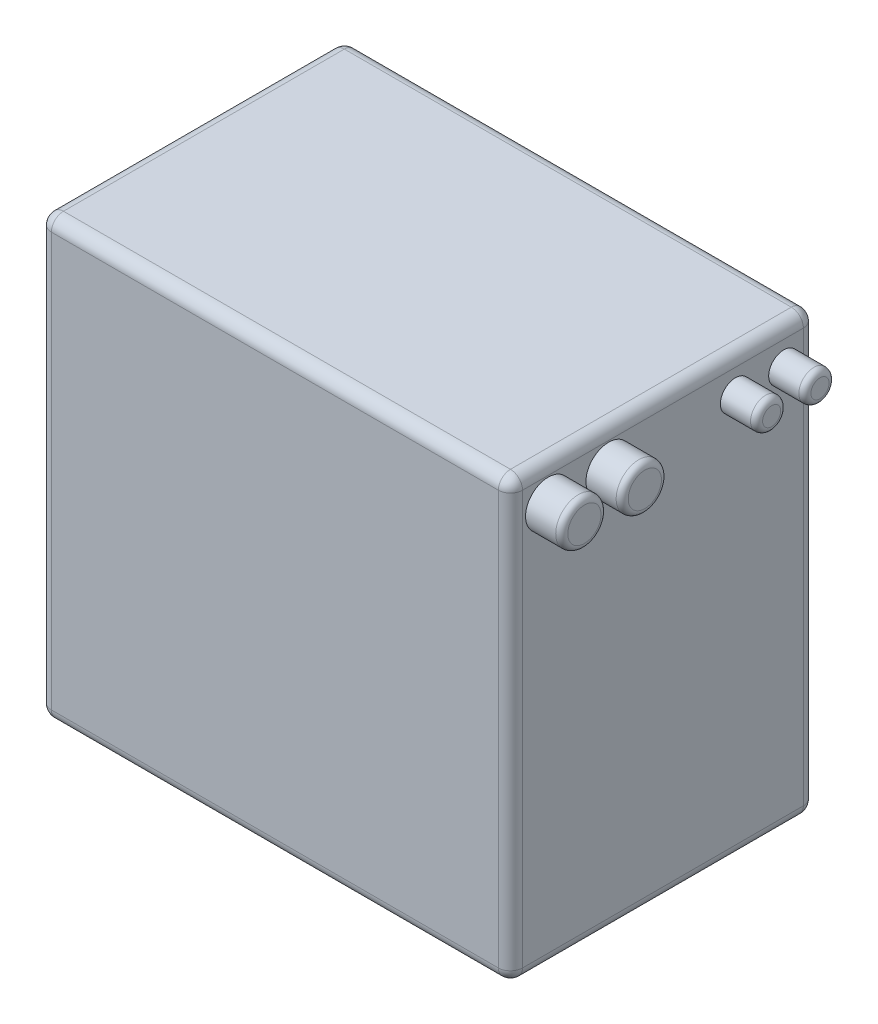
from build123d import *

# Parameters (mm, degrees)
SKETCH1_W             = 247.65
SKETCH1_H             = 230.1748
BOSS_EXTRUDE1_DEPTH   = 80.1624
FILLET1_R             = 6.35
SKETCH2_R             = 7.9375
BOSS_EXTRUDE2_DEPTH   = 19.05
BOSS_EXTRUDE2_2_DEPTH = 19.05
SKETCH2_R_2           = 11.9126
BOSS_EXTRUDE2_3_DEPTH = 19.05
BOSS_EXTRUDE2_4_DEPTH = 19.05
FILLET2_R             = 3.175
FILLET3_R             = 3.175
FILLET4_R             = 3.175
FILLET5_R             = 3.175


with BuildPart() as part:
    # Sketch1 → Boss-Extrude1 (new, symmetric)
    with BuildSketch(Plane.XY):
        with Locations((123.825, 115.0874)):
            Rectangle(SKETCH1_W, SKETCH1_H)
    extrude(amount=BOSS_EXTRUDE1_DEPTH, both=True)

    # Fillet1
    fillet1_edges = [part.edges().sort_by_distance(p)[0] for p in [
        (247.65, 115.0874, 80.1624),
        (123.825, 230.1748, 80.1624),
        (0, 115.0874, 80.1624),
        (123.825, 230.1748, -80.1624),
        (247.65, 115.0874, -80.1624),
        (123.825, 0, -80.1624),
        (0, 115.0874, -80.1624),
        (123.825, 0, 80.1624),
        (0, 230.1748, 0),
        (247.65, 230.1748, 0),
        (247.65, 0, 0),
        (0, 0, 0),
    ]]
    fillet(fillet1_edges, radius=FILLET1_R)


with BuildPart() as body_2:
    # Sketch2 → Boss-Extrude2 (new body)
    with BuildSketch(Plane(origin=(247.65, 0, 0), x_dir=(0, 0, -1), z_dir=(1, 0, 0))):
        with Locations(Location((63.5, 211.1248, 0), (0, 0, 180))):
            Circle(SKETCH2_R)
    extrude(amount=BOSS_EXTRUDE2_DEPTH)

    # Fillet5
    fillet5_edges = [body_2.edges().sort_by_distance(p)[0] for p in [
        (266.7, 211.1248, -71.4375),
    ]]
    fillet(fillet5_edges, radius=FILLET5_R)


with BuildPart() as body_3:
    # Sketch2 → Boss-Extrude2 2 (new body)
    with BuildSketch(Plane(origin=(247.65, 0, 0), x_dir=(0, 0, -1), z_dir=(1, 0, 0))):
        with Locations(Location((38.1, 211.1248, 0), (0, 0, 180))):
            Circle(SKETCH2_R)
    extrude(amount=BOSS_EXTRUDE2_2_DEPTH)

    # Fillet4
    fillet4_edges = [body_3.edges().sort_by_distance(p)[0] for p in [
        (266.7, 211.1248, -46.0375),
    ]]
    fillet(fillet4_edges, radius=FILLET4_R)


with BuildPart() as body_4:
    # Sketch2 → Boss-Extrude2 3 (new body)
    with BuildSketch(Plane(origin=(247.65, 0, 0), x_dir=(0, 0, -1), z_dir=(1, 0, 0))):
        with Locations(Location((-28.575, 211.1248, 0), (0, 0, 180))):
            Circle(SKETCH2_R_2)
    extrude(amount=BOSS_EXTRUDE2_3_DEPTH)

    # Fillet3
    fillet3_edges = [body_4.edges().sort_by_distance(p)[0] for p in [
        (266.7, 211.1248, 16.6624),
    ]]
    fillet(fillet3_edges, radius=FILLET3_R)


with BuildPart() as body_5:
    # Sketch2 → Boss-Extrude2 4 (new body)
    with BuildSketch(Plane(origin=(247.65, 0, 0), x_dir=(0, 0, -1), z_dir=(1, 0, 0))):
        with Locations(Location((-60.325, 211.1248, 0), (0, 0, 180))):
            Circle(SKETCH2_R_2)
    extrude(amount=BOSS_EXTRUDE2_4_DEPTH)

    # Fillet2
    fillet2_edges = [body_5.edges().sort_by_distance(p)[0] for p in [
        (266.7, 211.1248, 48.4124),
    ]]
    fillet(fillet2_edges, radius=FILLET2_R)


solid = Compound([part.part, body_2.part, body_3.part, body_4.part, body_5.part])
